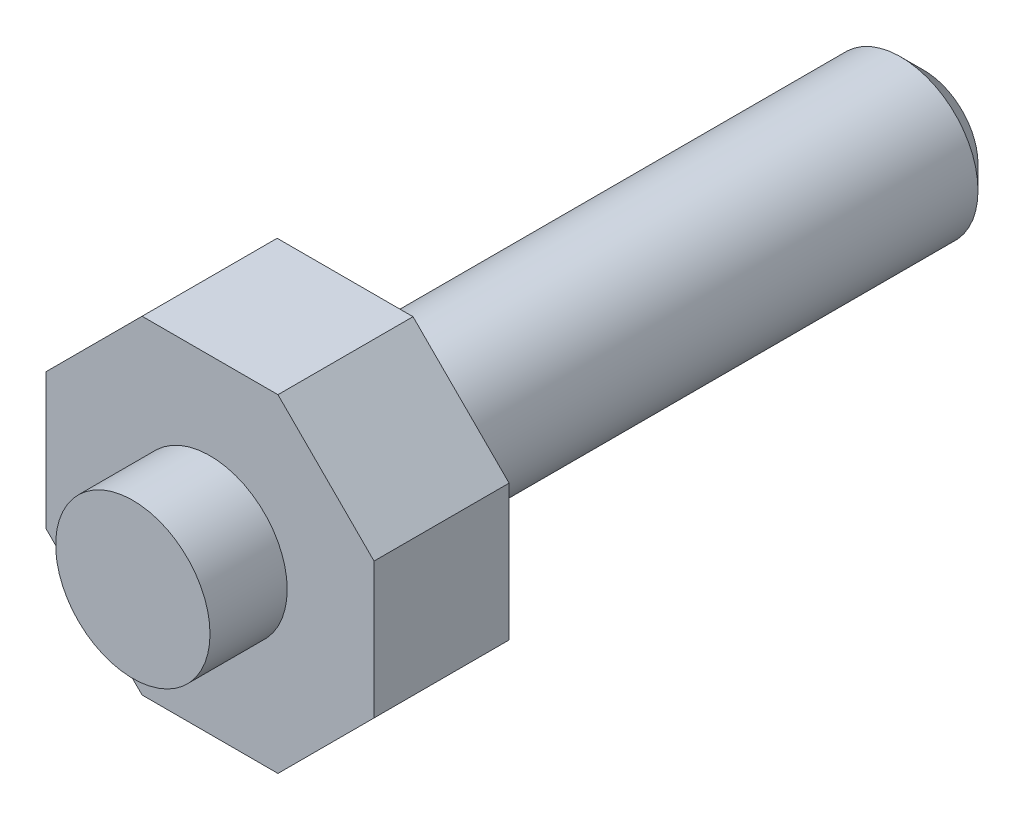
ISO-10303-21;
HEADER;
FILE_DESCRIPTION(('STEP AP214'),'2;1');
FILE_NAME('part.step','',(''),(''),'','','');
FILE_SCHEMA(('AUTOMOTIVE_DESIGN { 1 0 10303 214 1 1 1 1 }'));
ENDSEC;
DATA;
#1=APPLICATION_CONTEXT('core data for automotive mechanical design processes');
#2=APPLICATION_PROTOCOL_DEFINITION('international standard','automotive_design',2000,#1);
#3=PRODUCT_CONTEXT('',#1,'mechanical');
#4=PRODUCT('Part','Part','',(#3));
#5=PRODUCT_RELATED_PRODUCT_CATEGORY('part','',(#4));
#6=PRODUCT_DEFINITION_FORMATION('','',#4);
#7=PRODUCT_DEFINITION_CONTEXT('part definition',#1,'design');
#8=PRODUCT_DEFINITION('design','',#6,#7);
#9=PRODUCT_DEFINITION_SHAPE('','',#8);
#10=(LENGTH_UNIT() NAMED_UNIT(*) SI_UNIT(.MILLI.,.METRE.));
#11=(NAMED_UNIT(*) PLANE_ANGLE_UNIT() SI_UNIT($,.RADIAN.));
#12=(NAMED_UNIT(*) SI_UNIT($,.STERADIAN.) SOLID_ANGLE_UNIT());
#13=UNCERTAINTY_MEASURE_WITH_UNIT(LENGTH_MEASURE(1.E-05),#10,'distance_accuracy_value','');
#14=(GEOMETRIC_REPRESENTATION_CONTEXT(3) GLOBAL_UNCERTAINTY_ASSIGNED_CONTEXT((#13)) GLOBAL_UNIT_ASSIGNED_CONTEXT((#10,
#11,#12)) REPRESENTATION_CONTEXT('',''));
#15=CARTESIAN_POINT('',(0.,0.,0.));
#16=DIRECTION('',(0.,0.,1.));
#17=DIRECTION('',(1.,0.,0.));
#18=AXIS2_PLACEMENT_3D('',#15,#16,#17);
#19=CARTESIAN_POINT('',(4.,0.,30.));
#20=DIRECTION('',(0.,0.,1.));
#21=DIRECTION('',(1.,0.,0.));
#22=AXIS2_PLACEMENT_3D('',#19,#20,#21);
#23=PLANE('',#22);
#24=CARTESIAN_POINT('',(0.,0.,30.));
#25=DIRECTION('',(0.,0.,1.));
#26=DIRECTION('',(1.,0.,0.));
#27=AXIS2_PLACEMENT_3D('',#24,#25,#26);
#28=CIRCLE('',#27,4.);
#29=CARTESIAN_POINT('',(4.,0.,30.));
#30=VERTEX_POINT('',#29);
#31=EDGE_CURVE('E144',#30,#30,#28,.T.);
#32=ORIENTED_EDGE('',*,*,#31,.T.);
#33=EDGE_LOOP('',(#32));
#34=FACE_BOUND('',#33,.T.);
#35=DIRECTION('',(-0.707106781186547,-0.707106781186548,0.));
#36=VECTOR('',#35,1.);
#37=CARTESIAN_POINT('',(8.5,-3.52081528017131,30.));
#38=LINE('',#37,#36);
#39=CARTESIAN_POINT('',(8.5,-3.52081528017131,30.));
#40=VERTEX_POINT('',#39);
#41=CARTESIAN_POINT('',(3.52081528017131,-8.5,30.));
#42=VERTEX_POINT('',#41);
#43=EDGE_CURVE('E101',#40,#42,#38,.T.);
#44=ORIENTED_EDGE('',*,*,#43,.T.);
#45=DIRECTION('',(1.,0.,0.));
#46=VECTOR('',#45,1.);
#47=CARTESIAN_POINT('',(-3.5208152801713,-8.5,30.));
#48=LINE('',#47,#46);
#49=CARTESIAN_POINT('',(-3.5208152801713,-8.5,30.));
#50=VERTEX_POINT('',#49);
#51=EDGE_CURVE('E99',#50,#42,#48,.T.);
#52=ORIENTED_EDGE('',*,*,#51,.F.);
#53=DIRECTION('',(0.707106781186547,-0.707106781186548,0.));
#54=VECTOR('',#53,1.);
#55=CARTESIAN_POINT('',(-8.5,-3.5208152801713,30.));
#56=LINE('',#55,#54);
#57=CARTESIAN_POINT('',(-8.5,-3.5208152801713,30.));
#58=VERTEX_POINT('',#57);
#59=EDGE_CURVE('E29',#58,#50,#56,.T.);
#60=ORIENTED_EDGE('',*,*,#59,.F.);
#61=DIRECTION('',(0.,-1.,0.));
#62=VECTOR('',#61,1.);
#63=CARTESIAN_POINT('',(-8.5,3.52081528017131,30.));
#64=LINE('',#63,#62);
#65=CARTESIAN_POINT('',(-8.5,3.52081528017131,30.));
#66=VERTEX_POINT('',#65);
#67=EDGE_CURVE('E89',#66,#58,#64,.T.);
#68=ORIENTED_EDGE('',*,*,#67,.F.);
#69=DIRECTION('',(0.707106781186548,0.707106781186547,0.));
#70=VECTOR('',#69,1.);
#71=CARTESIAN_POINT('',(-8.5,3.52081528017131,30.));
#72=LINE('',#71,#70);
#73=CARTESIAN_POINT('',(-3.5208152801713,8.5,30.));
#74=VERTEX_POINT('',#73);
#75=EDGE_CURVE('E94',#66,#74,#72,.T.);
#76=ORIENTED_EDGE('',*,*,#75,.T.);
#77=DIRECTION('',(1.,0.,0.));
#78=VECTOR('',#77,1.);
#79=CARTESIAN_POINT('',(-3.5208152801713,8.5,30.));
#80=LINE('',#79,#78);
#81=CARTESIAN_POINT('',(3.5208152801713,8.5,30.));
#82=VERTEX_POINT('',#81);
#83=EDGE_CURVE('E233',#74,#82,#80,.T.);
#84=ORIENTED_EDGE('',*,*,#83,.T.);
#85=DIRECTION('',(0.707106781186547,-0.707106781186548,0.));
#86=VECTOR('',#85,1.);
#87=CARTESIAN_POINT('',(3.5208152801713,8.5,30.));
#88=LINE('',#87,#86);
#89=CARTESIAN_POINT('',(8.5,3.5208152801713,30.));
#90=VERTEX_POINT('',#89);
#91=EDGE_CURVE('E231',#82,#90,#88,.T.);
#92=ORIENTED_EDGE('',*,*,#91,.T.);
#93=DIRECTION('',(0.,-1.,0.));
#94=VECTOR('',#93,1.);
#95=CARTESIAN_POINT('',(8.5,3.5208152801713,30.));
#96=LINE('',#95,#94);
#97=EDGE_CURVE('E126',#90,#40,#96,.T.);
#98=ORIENTED_EDGE('',*,*,#97,.T.);
#99=EDGE_LOOP('',(#44,#52,#60,#68,#76,#84,#92,#98));
#100=FACE_BOUND('',#99,.T.);
#101=ADVANCED_FACE('F14',(#34,#100),#23,.F.);
#102=CARTESIAN_POINT('',(0.,0.,0.));
#103=DIRECTION('',(0.,0.,1.));
#104=DIRECTION('',(1.,0.,0.));
#105=AXIS2_PLACEMENT_3D('',#102,#103,#104);
#106=PLANE('',#105);
#107=CARTESIAN_POINT('',(0.,0.,0.));
#108=DIRECTION('',(0.,0.,1.));
#109=DIRECTION('',(1.,0.,0.));
#110=AXIS2_PLACEMENT_3D('',#107,#108,#109);
#111=CIRCLE('',#110,2.8);
#112=CARTESIAN_POINT('',(2.8,0.,0.));
#113=VERTEX_POINT('',#112);
#114=EDGE_CURVE('E9',#113,#113,#111,.F.);
#115=ORIENTED_EDGE('',*,*,#114,.T.);
#116=EDGE_LOOP('',(#115));
#117=FACE_BOUND('',#116,.T.);
#118=ADVANCED_FACE('F165',(#117),#106,.F.);
#119=CARTESIAN_POINT('',(0.,0.,80.));
#120=DIRECTION('',(0.,0.,1.));
#121=DIRECTION('',(1.,0.,0.));
#122=AXIS2_PLACEMENT_3D('',#119,#120,#121);
#123=CYLINDRICAL_SURFACE('',#122,4.);
#124=CARTESIAN_POINT('',(0.,0.,1.2));
#125=DIRECTION('',(0.,0.,1.));
#126=DIRECTION('',(1.,0.,0.));
#127=AXIS2_PLACEMENT_3D('',#124,#125,#126);
#128=CIRCLE('',#127,4.);
#129=CARTESIAN_POINT('',(4.,0.,1.2));
#130=VERTEX_POINT('',#129);
#131=EDGE_CURVE('E22',#130,#130,#128,.T.);
#132=ORIENTED_EDGE('',*,*,#131,.T.);
#133=EDGE_LOOP('',(#132));
#134=FACE_BOUND('',#133,.T.);
#135=ORIENTED_EDGE('',*,*,#31,.F.);
#136=EDGE_LOOP('',(#135));
#137=FACE_BOUND('',#136,.T.);
#138=ADVANCED_FACE('F149',(#134,#137),#123,.T.);
#139=CARTESIAN_POINT('',(8.5,-3.52081528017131,37.));
#140=DIRECTION('',(0.707106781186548,-0.707106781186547,0.));
#141=DIRECTION('',(0.707106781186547,0.707106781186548,0.));
#142=AXIS2_PLACEMENT_3D('',#139,#140,#141);
#143=PLANE('',#142);
#144=DIRECTION('',(0.,0.,-1.));
#145=VECTOR('',#144,1.);
#146=CARTESIAN_POINT('',(8.5,-3.52081528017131,37.));
#147=LINE('',#146,#145);
#148=CARTESIAN_POINT('',(8.5,-3.52081528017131,37.));
#149=VERTEX_POINT('',#148);
#150=EDGE_CURVE('E136',#149,#40,#147,.T.);
#151=ORIENTED_EDGE('',*,*,#150,.F.);
#152=DIRECTION('',(-0.707106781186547,-0.707106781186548,0.));
#153=VECTOR('',#152,1.);
#154=CARTESIAN_POINT('',(8.5,-3.52081528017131,37.));
#155=LINE('',#154,#153);
#156=CARTESIAN_POINT('',(3.52081528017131,-8.5,37.));
#157=VERTEX_POINT('',#156);
#158=EDGE_CURVE('E37',#149,#157,#155,.T.);
#159=ORIENTED_EDGE('',*,*,#158,.T.);
#160=DIRECTION('',(0.,0.,-1.));
#161=VECTOR('',#160,1.);
#162=CARTESIAN_POINT('',(3.52081528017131,-8.5,37.));
#163=LINE('',#162,#161);
#164=EDGE_CURVE('E109',#157,#42,#163,.T.);
#165=ORIENTED_EDGE('',*,*,#164,.T.);
#166=ORIENTED_EDGE('',*,*,#43,.F.);
#167=EDGE_LOOP('',(#151,#159,#165,#166));
#168=FACE_BOUND('',#167,.T.);
#169=ADVANCED_FACE('F176',(#168),#143,.T.);
#170=CARTESIAN_POINT('',(8.5,3.5208152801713,37.));
#171=DIRECTION('',(1.,0.,0.));
#172=DIRECTION('',(0.,1.,0.));
#173=AXIS2_PLACEMENT_3D('',#170,#171,#172);
#174=PLANE('',#173);
#175=DIRECTION('',(0.,0.,-1.));
#176=VECTOR('',#175,1.);
#177=CARTESIAN_POINT('',(8.5,3.5208152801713,37.));
#178=LINE('',#177,#176);
#179=CARTESIAN_POINT('',(8.5,3.5208152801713,37.));
#180=VERTEX_POINT('',#179);
#181=EDGE_CURVE('E134',#180,#90,#178,.T.);
#182=ORIENTED_EDGE('',*,*,#181,.F.);
#183=DIRECTION('',(0.,-1.,0.));
#184=VECTOR('',#183,1.);
#185=CARTESIAN_POINT('',(8.5,3.5208152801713,37.));
#186=LINE('',#185,#184);
#187=EDGE_CURVE('E106',#180,#149,#186,.T.);
#188=ORIENTED_EDGE('',*,*,#187,.T.);
#189=ORIENTED_EDGE('',*,*,#150,.T.);
#190=ORIENTED_EDGE('',*,*,#97,.F.);
#191=EDGE_LOOP('',(#182,#188,#189,#190));
#192=FACE_BOUND('',#191,.T.);
#193=ADVANCED_FACE('F181',(#192),#174,.T.);
#194=CARTESIAN_POINT('',(3.5208152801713,8.5,37.));
#195=DIRECTION('',(0.707106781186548,0.707106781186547,0.));
#196=DIRECTION('',(-0.707106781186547,0.707106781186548,0.));
#197=AXIS2_PLACEMENT_3D('',#194,#195,#196);
#198=PLANE('',#197);
#199=DIRECTION('',(0.,0.,-1.));
#200=VECTOR('',#199,1.);
#201=CARTESIAN_POINT('',(3.5208152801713,8.5,37.));
#202=LINE('',#201,#200);
#203=CARTESIAN_POINT('',(3.5208152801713,8.5,37.));
#204=VERTEX_POINT('',#203);
#205=EDGE_CURVE('E132',#204,#82,#202,.T.);
#206=ORIENTED_EDGE('',*,*,#205,.F.);
#207=DIRECTION('',(0.707106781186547,-0.707106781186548,0.));
#208=VECTOR('',#207,1.);
#209=CARTESIAN_POINT('',(3.5208152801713,8.5,37.));
#210=LINE('',#209,#208);
#211=EDGE_CURVE('E110',#204,#180,#210,.T.);
#212=ORIENTED_EDGE('',*,*,#211,.T.);
#213=ORIENTED_EDGE('',*,*,#181,.T.);
#214=ORIENTED_EDGE('',*,*,#91,.F.);
#215=EDGE_LOOP('',(#206,#212,#213,#214));
#216=FACE_BOUND('',#215,.T.);
#217=ADVANCED_FACE('F187',(#216),#198,.T.);
#218=CARTESIAN_POINT('',(-3.5208152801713,8.5,37.));
#219=DIRECTION('',(0.,1.,0.));
#220=DIRECTION('',(0.,0.,1.));
#221=AXIS2_PLACEMENT_3D('',#218,#219,#220);
#222=PLANE('',#221);
#223=DIRECTION('',(0.,0.,-1.));
#224=VECTOR('',#223,1.);
#225=CARTESIAN_POINT('',(-3.5208152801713,8.5,37.));
#226=LINE('',#225,#224);
#227=CARTESIAN_POINT('',(-3.5208152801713,8.5,37.));
#228=VERTEX_POINT('',#227);
#229=EDGE_CURVE('E130',#228,#74,#226,.T.);
#230=ORIENTED_EDGE('',*,*,#229,.F.);
#231=DIRECTION('',(1.,0.,0.));
#232=VECTOR('',#231,1.);
#233=CARTESIAN_POINT('',(-3.5208152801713,8.5,37.));
#234=LINE('',#233,#232);
#235=EDGE_CURVE('E113',#228,#204,#234,.T.);
#236=ORIENTED_EDGE('',*,*,#235,.T.);
#237=ORIENTED_EDGE('',*,*,#205,.T.);
#238=ORIENTED_EDGE('',*,*,#83,.F.);
#239=EDGE_LOOP('',(#230,#236,#237,#238));
#240=FACE_BOUND('',#239,.T.);
#241=ADVANCED_FACE('F203',(#240),#222,.T.);
#242=CARTESIAN_POINT('',(-8.5,3.52081528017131,37.));
#243=DIRECTION('',(-0.707106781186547,0.707106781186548,0.));
#244=DIRECTION('',(-0.707106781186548,-0.707106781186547,0.));
#245=AXIS2_PLACEMENT_3D('',#242,#243,#244);
#246=PLANE('',#245);
#247=DIRECTION('',(0.,0.,-1.));
#248=VECTOR('',#247,1.);
#249=CARTESIAN_POINT('',(-8.5,3.52081528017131,37.));
#250=LINE('',#249,#248);
#251=CARTESIAN_POINT('',(-8.5,3.52081528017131,37.));
#252=VERTEX_POINT('',#251);
#253=EDGE_CURVE('E85',#252,#66,#250,.T.);
#254=ORIENTED_EDGE('',*,*,#253,.F.);
#255=DIRECTION('',(0.707106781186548,0.707106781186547,0.));
#256=VECTOR('',#255,1.);
#257=CARTESIAN_POINT('',(-8.5,3.52081528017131,37.));
#258=LINE('',#257,#256);
#259=EDGE_CURVE('E116',#252,#228,#258,.T.);
#260=ORIENTED_EDGE('',*,*,#259,.T.);
#261=ORIENTED_EDGE('',*,*,#229,.T.);
#262=ORIENTED_EDGE('',*,*,#75,.F.);
#263=EDGE_LOOP('',(#254,#260,#261,#262));
#264=FACE_BOUND('',#263,.T.);
#265=ADVANCED_FACE('F200',(#264),#246,.T.);
#266=CARTESIAN_POINT('',(-8.5,3.52081528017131,37.));
#267=DIRECTION('',(1.,0.,0.));
#268=DIRECTION('',(0.,1.,0.));
#269=AXIS2_PLACEMENT_3D('',#266,#267,#268);
#270=PLANE('',#269);
#271=DIRECTION('',(0.,0.,-1.));
#272=VECTOR('',#271,1.);
#273=CARTESIAN_POINT('',(-8.5,-3.5208152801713,37.));
#274=LINE('',#273,#272);
#275=CARTESIAN_POINT('',(-8.5,-3.5208152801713,37.));
#276=VERTEX_POINT('',#275);
#277=EDGE_CURVE('E77',#276,#58,#274,.T.);
#278=ORIENTED_EDGE('',*,*,#277,.F.);
#279=DIRECTION('',(0.,-1.,0.));
#280=VECTOR('',#279,1.);
#281=CARTESIAN_POINT('',(-8.5,3.52081528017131,37.));
#282=LINE('',#281,#280);
#283=EDGE_CURVE('E119',#252,#276,#282,.T.);
#284=ORIENTED_EDGE('',*,*,#283,.F.);
#285=ORIENTED_EDGE('',*,*,#253,.T.);
#286=ORIENTED_EDGE('',*,*,#67,.T.);
#287=EDGE_LOOP('',(#278,#284,#285,#286));
#288=FACE_BOUND('',#287,.T.);
#289=ADVANCED_FACE('F90',(#288),#270,.F.);
#290=CARTESIAN_POINT('',(-8.5,-3.5208152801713,37.));
#291=DIRECTION('',(0.707106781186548,0.707106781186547,0.));
#292=DIRECTION('',(-0.707106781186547,0.707106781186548,0.));
#293=AXIS2_PLACEMENT_3D('',#290,#291,#292);
#294=PLANE('',#293);
#295=DIRECTION('',(0.,0.,-1.));
#296=VECTOR('',#295,1.);
#297=CARTESIAN_POINT('',(-3.5208152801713,-8.5,37.));
#298=LINE('',#297,#296);
#299=CARTESIAN_POINT('',(-3.5208152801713,-8.5,37.));
#300=VERTEX_POINT('',#299);
#301=EDGE_CURVE('E86',#300,#50,#298,.T.);
#302=ORIENTED_EDGE('',*,*,#301,.F.);
#303=DIRECTION('',(0.707106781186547,-0.707106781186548,0.));
#304=VECTOR('',#303,1.);
#305=CARTESIAN_POINT('',(-8.5,-3.5208152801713,37.));
#306=LINE('',#305,#304);
#307=EDGE_CURVE('E81',#276,#300,#306,.T.);
#308=ORIENTED_EDGE('',*,*,#307,.F.);
#309=ORIENTED_EDGE('',*,*,#277,.T.);
#310=ORIENTED_EDGE('',*,*,#59,.T.);
#311=EDGE_LOOP('',(#302,#308,#309,#310));
#312=FACE_BOUND('',#311,.T.);
#313=ADVANCED_FACE('F79',(#312),#294,.F.);
#314=CARTESIAN_POINT('',(-3.5208152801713,-8.5,37.));
#315=DIRECTION('',(0.,1.,0.));
#316=DIRECTION('',(0.,0.,1.));
#317=AXIS2_PLACEMENT_3D('',#314,#315,#316);
#318=PLANE('',#317);
#319=DIRECTION('',(1.,0.,0.));
#320=VECTOR('',#319,1.);
#321=CARTESIAN_POINT('',(-3.5208152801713,-8.5,37.));
#322=LINE('',#321,#320);
#323=EDGE_CURVE('E122',#300,#157,#322,.T.);
#324=ORIENTED_EDGE('',*,*,#323,.F.);
#325=ORIENTED_EDGE('',*,*,#301,.T.);
#326=ORIENTED_EDGE('',*,*,#51,.T.);
#327=ORIENTED_EDGE('',*,*,#164,.F.);
#328=EDGE_LOOP('',(#324,#325,#326,#327));
#329=FACE_BOUND('',#328,.T.);
#330=ADVANCED_FACE('F191',(#329),#318,.F.);
#331=CARTESIAN_POINT('',(4.,0.,41.));
#332=DIRECTION('',(0.,0.,-1.));
#333=DIRECTION('',(-1.,0.,0.));
#334=AXIS2_PLACEMENT_3D('',#331,#332,#333);
#335=PLANE('',#334);
#336=CARTESIAN_POINT('',(0.,0.,41.));
#337=DIRECTION('',(0.,0.,1.));
#338=DIRECTION('',(1.,0.,0.));
#339=AXIS2_PLACEMENT_3D('',#336,#337,#338);
#340=CIRCLE('',#339,4.);
#341=CARTESIAN_POINT('',(4.,0.,41.));
#342=VERTEX_POINT('',#341);
#343=EDGE_CURVE('E138',#342,#342,#340,.T.);
#344=ORIENTED_EDGE('',*,*,#343,.T.);
#345=EDGE_LOOP('',(#344));
#346=FACE_BOUND('',#345,.T.);
#347=ADVANCED_FACE('F194',(#346),#335,.F.);
#348=CARTESIAN_POINT('',(0.,0.,80.));
#349=DIRECTION('',(0.,0.,1.));
#350=DIRECTION('',(1.,0.,0.));
#351=AXIS2_PLACEMENT_3D('',#348,#349,#350);
#352=CYLINDRICAL_SURFACE('',#351,4.);
#353=ORIENTED_EDGE('',*,*,#343,.F.);
#354=EDGE_LOOP('',(#353));
#355=FACE_BOUND('',#354,.T.);
#356=CARTESIAN_POINT('',(0.,0.,37.));
#357=DIRECTION('',(0.,0.,1.));
#358=DIRECTION('',(1.,0.,0.));
#359=AXIS2_PLACEMENT_3D('',#356,#357,#358);
#360=CIRCLE('',#359,4.);
#361=CARTESIAN_POINT('',(4.,0.,37.));
#362=VERTEX_POINT('',#361);
#363=EDGE_CURVE('E141',#362,#362,#360,.T.);
#364=ORIENTED_EDGE('',*,*,#363,.T.);
#365=EDGE_LOOP('',(#364));
#366=FACE_BOUND('',#365,.T.);
#367=ADVANCED_FACE('F160',(#355,#366),#352,.T.);
#368=CARTESIAN_POINT('',(10.,0.,37.));
#369=DIRECTION('',(0.,0.,-1.));
#370=DIRECTION('',(-1.,0.,0.));
#371=AXIS2_PLACEMENT_3D('',#368,#369,#370);
#372=PLANE('',#371);
#373=ORIENTED_EDGE('',*,*,#363,.F.);
#374=EDGE_LOOP('',(#373));
#375=FACE_BOUND('',#374,.T.);
#376=ORIENTED_EDGE('',*,*,#158,.F.);
#377=ORIENTED_EDGE('',*,*,#187,.F.);
#378=ORIENTED_EDGE('',*,*,#211,.F.);
#379=ORIENTED_EDGE('',*,*,#235,.F.);
#380=ORIENTED_EDGE('',*,*,#259,.F.);
#381=ORIENTED_EDGE('',*,*,#283,.T.);
#382=ORIENTED_EDGE('',*,*,#307,.T.);
#383=ORIENTED_EDGE('',*,*,#323,.T.);
#384=EDGE_LOOP('',(#376,#377,#378,#379,#380,#381,#382,#383));
#385=FACE_BOUND('',#384,.T.);
#386=ADVANCED_FACE('F153',(#375,#385),#372,.F.);
#387=CARTESIAN_POINT('',(0.,0.,1.2));
#388=DIRECTION('',(0.,0.,1.));
#389=DIRECTION('',(1.,0.,0.));
#390=AXIS2_PLACEMENT_3D('',#387,#388,#389);
#391=CONICAL_SURFACE('',#390,4.,0.785398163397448);
#392=ORIENTED_EDGE('',*,*,#114,.F.);
#393=EDGE_LOOP('',(#392));
#394=FACE_BOUND('',#393,.T.);
#395=ORIENTED_EDGE('',*,*,#131,.F.);
#396=EDGE_LOOP('',(#395));
#397=FACE_BOUND('',#396,.T.);
#398=ADVANCED_FACE('F16',(#394,#397),#391,.T.);
#399=CLOSED_SHELL('',(#101,#118,#138,#169,#193,#217,#241,#265,#289,#313,#330,#347,#367,#386,#398));
#400=MANIFOLD_SOLID_BREP('B1',#399);
#401=ADVANCED_BREP_SHAPE_REPRESENTATION('',(#18,#400),#14);
#402=SHAPE_DEFINITION_REPRESENTATION(#9,#401);
ENDSEC;
END-ISO-10303-21;
